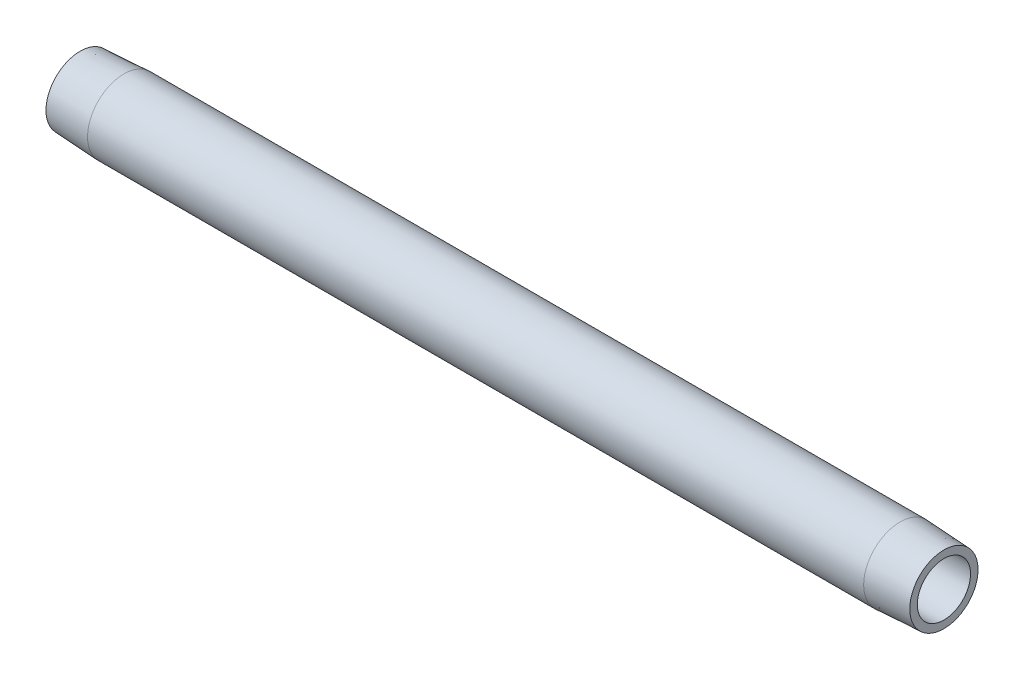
from build123d import *


with BuildPart() as part:
    # Sketch1 → Revolve1 (revolve)
    with BuildSketch(Plane.XY, mode=Mode.PRIVATE) as revolve1_sk:
        Polygon((203.2, 6.2611), (0, 6.2611), (0, 8.032050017), (10.3124, 8.5725), (192.8876, 8.5725), (203.2, 8.032050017), align=None)
    revolve(revolve1_sk.sketch.rotate(Axis((0, 0, 0), (1, 0, 0)), 90), axis=Axis((0, 0, 0), (1, 0, 0)))


solid = part.part
